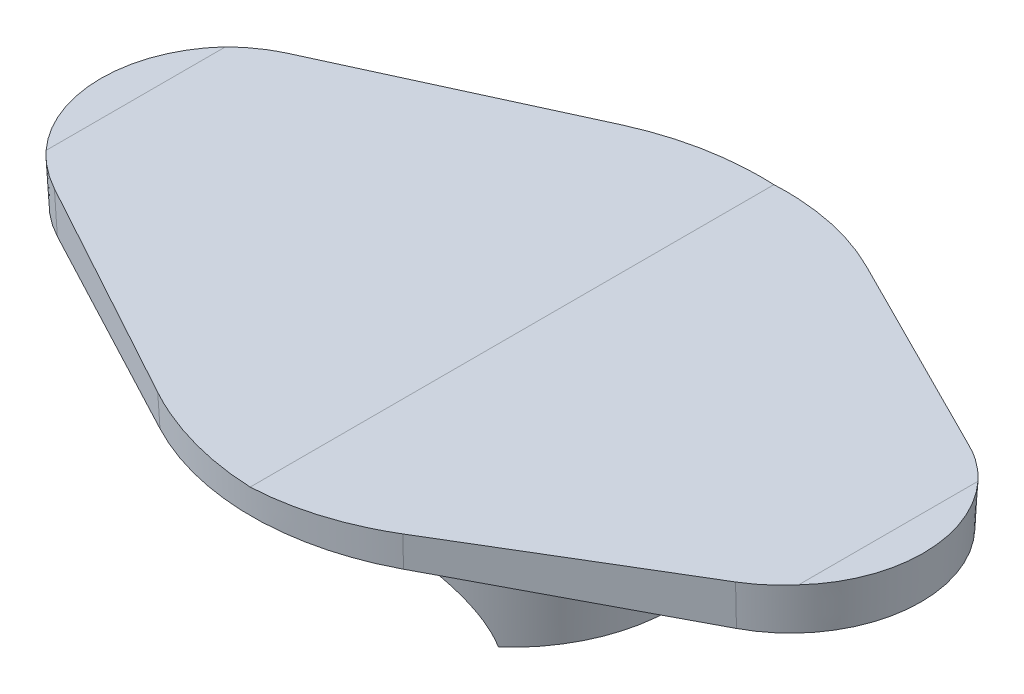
ISO-10303-21;
HEADER;
FILE_DESCRIPTION(('STEP AP214'),'2;1');
FILE_NAME('part.step','',(''),(''),'','','');
FILE_SCHEMA(('AUTOMOTIVE_DESIGN { 1 0 10303 214 1 1 1 1 }'));
ENDSEC;
DATA;
#1=APPLICATION_CONTEXT('core data for automotive mechanical design processes');
#2=APPLICATION_PROTOCOL_DEFINITION('international standard','automotive_design',2000,#1);
#3=PRODUCT_CONTEXT('',#1,'mechanical');
#4=PRODUCT('Part','Part','',(#3));
#5=PRODUCT_RELATED_PRODUCT_CATEGORY('part','',(#4));
#6=PRODUCT_DEFINITION_FORMATION('','',#4);
#7=PRODUCT_DEFINITION_CONTEXT('part definition',#1,'design');
#8=PRODUCT_DEFINITION('design','',#6,#7);
#9=PRODUCT_DEFINITION_SHAPE('','',#8);
#10=(LENGTH_UNIT() NAMED_UNIT(*) SI_UNIT(.MILLI.,.METRE.));
#11=(NAMED_UNIT(*) PLANE_ANGLE_UNIT() SI_UNIT($,.RADIAN.));
#12=(NAMED_UNIT(*) SI_UNIT($,.STERADIAN.) SOLID_ANGLE_UNIT());
#13=UNCERTAINTY_MEASURE_WITH_UNIT(LENGTH_MEASURE(1.E-05),#10,'distance_accuracy_value','');
#14=(GEOMETRIC_REPRESENTATION_CONTEXT(3) GLOBAL_UNCERTAINTY_ASSIGNED_CONTEXT((#13)) GLOBAL_UNIT_ASSIGNED_CONTEXT((#10,
#11,#12)) REPRESENTATION_CONTEXT('',''));
#15=CARTESIAN_POINT('',(0.,0.,0.));
#16=DIRECTION('',(0.,0.,1.));
#17=DIRECTION('',(1.,0.,0.));
#18=AXIS2_PLACEMENT_3D('',#15,#16,#17);
#19=CARTESIAN_POINT('',(0.,0.,0.));
#20=DIRECTION('',(0.,1.,0.));
#21=DIRECTION('',(0.,0.,1.));
#22=AXIS2_PLACEMENT_3D('',#19,#20,#21);
#23=CONICAL_SURFACE('',#22,7.62,0.05235987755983);
#24=CARTESIAN_POINT('',(0.0185301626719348,0.762855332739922,0.));
#25=DIRECTION('',(-0.0461098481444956,0.998936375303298,0.));
#26=DIRECTION('',(0.998936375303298,0.0461098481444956,0.));
#27=AXIS2_PLACEMENT_3D('',#24,#25,#26);
#28=ELLIPSE('',#27,7.66813557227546,7.65995714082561);
#29=CARTESIAN_POINT('',(3.58431728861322,0.927448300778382,-6.7793937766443));
#30=VERTEX_POINT('',#29);
#31=CARTESIAN_POINT('',(0.,0.762,-7.65993472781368));
#32=VERTEX_POINT('',#31);
#33=EDGE_CURVE('E159',#30,#32,#28,.T.);
#34=ORIENTED_EDGE('',*,*,#33,.F.);
#35=DIRECTION('',(0.024461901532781,0.998629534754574,-0.0462673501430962));
#36=VECTOR('',#35,1.);
#37=CARTESIAN_POINT('',(3.56159900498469,0.,-6.73642431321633));
#38=LINE('',#37,#36);
#39=CARTESIAN_POINT('',(3.56159900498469,0.,-6.73642431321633));
#40=VERTEX_POINT('',#39);
#41=EDGE_CURVE('E327',#30,#40,#38,.F.);
#42=ORIENTED_EDGE('',*,*,#41,.T.);
#43=CARTESIAN_POINT('',(0.,0.,0.));
#44=DIRECTION('',(0.,1.,0.));
#45=DIRECTION('',(0.,0.,1.));
#46=AXIS2_PLACEMENT_3D('',#43,#44,#45);
#47=CIRCLE('',#46,7.62);
#48=CARTESIAN_POINT('',(-3.56159900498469,0.,-6.73642431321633));
#49=VERTEX_POINT('',#48);
#50=EDGE_CURVE('E308',#40,#49,#47,.T.);
#51=ORIENTED_EDGE('',*,*,#50,.T.);
#52=DIRECTION('',(-0.024461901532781,0.998629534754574,-0.0462673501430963));
#53=VECTOR('',#52,1.);
#54=CARTESIAN_POINT('',(-3.56159900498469,0.,-6.73642431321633));
#55=LINE('',#54,#53);
#56=CARTESIAN_POINT('',(-3.58431728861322,0.927448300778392,-6.77939377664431));
#57=VERTEX_POINT('',#56);
#58=EDGE_CURVE('E278',#57,#49,#55,.F.);
#59=ORIENTED_EDGE('',*,*,#58,.F.);
#60=CARTESIAN_POINT('',(-0.0185301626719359,0.762855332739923,0.));
#61=DIRECTION('',(-0.0461098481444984,-0.998936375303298,0.));
#62=DIRECTION('',(-0.998936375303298,0.0461098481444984,0.));
#63=AXIS2_PLACEMENT_3D('',#60,#61,#62);
#64=ELLIPSE('',#63,7.66813557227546,7.65995714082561);
#65=EDGE_CURVE('E181',#57,#32,#64,.T.);
#66=ORIENTED_EDGE('',*,*,#65,.T.);
#67=EDGE_LOOP('',(#34,#42,#51,#59,#66));
#68=FACE_BOUND('',#67,.T.);
#69=ADVANCED_FACE('F35',(#68),#23,.T.);
#70=CARTESIAN_POINT('',(0.,0.,0.));
#71=DIRECTION('',(0.,1.,0.));
#72=DIRECTION('',(0.,0.,1.));
#73=AXIS2_PLACEMENT_3D('',#70,#71,#72);
#74=CONICAL_SURFACE('',#73,7.61999999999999,0.05235987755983);
#75=CARTESIAN_POINT('',(0.0185301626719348,0.762855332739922,0.));
#76=DIRECTION('',(-0.0461098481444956,0.998936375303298,0.));
#77=DIRECTION('',(0.998936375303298,0.0461098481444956,0.));
#78=AXIS2_PLACEMENT_3D('',#75,#76,#77);
#79=ELLIPSE('',#78,7.66813557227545,7.65995714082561);
#80=CARTESIAN_POINT('',(0.,0.762,7.65993472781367));
#81=VERTEX_POINT('',#80);
#82=CARTESIAN_POINT('',(3.58431728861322,0.927448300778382,6.7793937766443));
#83=VERTEX_POINT('',#82);
#84=EDGE_CURVE('E166',#81,#83,#79,.T.);
#85=ORIENTED_EDGE('',*,*,#84,.F.);
#86=CARTESIAN_POINT('',(-0.0185301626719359,0.762855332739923,0.));
#87=DIRECTION('',(-0.0461098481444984,-0.998936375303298,0.));
#88=DIRECTION('',(-0.998936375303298,0.0461098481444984,0.));
#89=AXIS2_PLACEMENT_3D('',#86,#87,#88);
#90=ELLIPSE('',#89,7.66813557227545,7.65995714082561);
#91=CARTESIAN_POINT('',(-3.58431728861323,0.927448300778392,6.7793937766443));
#92=VERTEX_POINT('',#91);
#93=EDGE_CURVE('E148',#81,#92,#90,.T.);
#94=ORIENTED_EDGE('',*,*,#93,.T.);
#95=DIRECTION('',(-0.0244619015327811,0.998629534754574,0.0462673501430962));
#96=VECTOR('',#95,1.);
#97=CARTESIAN_POINT('',(-3.56159900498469,0.,6.73642431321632));
#98=LINE('',#97,#96);
#99=CARTESIAN_POINT('',(-3.56159900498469,0.,6.73642431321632));
#100=VERTEX_POINT('',#99);
#101=EDGE_CURVE('E283',#92,#100,#98,.F.);
#102=ORIENTED_EDGE('',*,*,#101,.T.);
#103=CARTESIAN_POINT('',(0.,0.,0.));
#104=DIRECTION('',(0.,1.,0.));
#105=DIRECTION('',(0.,0.,1.));
#106=AXIS2_PLACEMENT_3D('',#103,#104,#105);
#107=CIRCLE('',#106,7.61999999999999);
#108=CARTESIAN_POINT('',(3.56159900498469,0.,6.73642431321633));
#109=VERTEX_POINT('',#108);
#110=EDGE_CURVE('E317',#100,#109,#107,.T.);
#111=ORIENTED_EDGE('',*,*,#110,.T.);
#112=DIRECTION('',(0.024461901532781,0.998629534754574,0.0462673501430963));
#113=VECTOR('',#112,1.);
#114=CARTESIAN_POINT('',(3.56159900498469,0.,6.73642431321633));
#115=LINE('',#114,#113);
#116=EDGE_CURVE('E333',#83,#109,#115,.F.);
#117=ORIENTED_EDGE('',*,*,#116,.F.);
#118=EDGE_LOOP('',(#85,#94,#102,#111,#117));
#119=FACE_BOUND('',#118,.T.);
#120=ADVANCED_FACE('F243',(#119),#74,.T.);
#121=CARTESIAN_POINT('',(9.93225056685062,0.,3.36821215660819));
#122=DIRECTION('',(0.466760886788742,-0.0523359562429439,0.882833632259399));
#123=DIRECTION('',(0.88404518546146,0.,-0.467401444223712));
#124=AXIS2_PLACEMENT_3D('',#121,#122,#123);
#125=PLANE('',#124);
#126=DIRECTION('',(-0.88430624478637,-0.0408186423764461,0.465119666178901));
#127=VECTOR('',#126,1.);
#128=CARTESIAN_POINT('',(9.91795517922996,1.21980233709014,3.44808230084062));
#129=LINE('',#128,#127);
#130=CARTESIAN_POINT('',(9.9621802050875,1.22184371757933,3.4248212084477));
#131=VERTEX_POINT('',#130);
#132=EDGE_CURVE('E165',#83,#131,#129,.F.);
#133=ORIENTED_EDGE('',*,*,#132,.F.);
#134=ORIENTED_EDGE('',*,*,#116,.T.);
#135=DIRECTION('',(0.88404518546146,0.,-0.467401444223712));
#136=VECTOR('',#135,1.);
#137=CARTESIAN_POINT('',(9.93225056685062,0.,3.36821215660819));
#138=LINE('',#137,#136);
#139=CARTESIAN_POINT('',(9.93225056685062,0.,3.36821215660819));
#140=VERTEX_POINT('',#139);
#141=EDGE_CURVE('E320',#109,#140,#138,.T.);
#142=ORIENTED_EDGE('',*,*,#141,.T.);
#143=DIRECTION('',(0.0244619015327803,0.998629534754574,0.0462673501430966));
#144=VECTOR('',#143,1.);
#145=CARTESIAN_POINT('',(9.93225056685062,0.,3.36821215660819));
#146=LINE('',#145,#144);
#147=EDGE_CURVE('E331',#131,#140,#146,.F.);
#148=ORIENTED_EDGE('',*,*,#147,.F.);
#149=EDGE_LOOP('',(#133,#134,#142,#148));
#150=FACE_BOUND('',#149,.T.);
#151=ADVANCED_FACE('F251',(#150),#125,.T.);
#152=CARTESIAN_POINT('',(8.15145106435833,0.,0.));
#153=DIRECTION('',(0.,1.,0.));
#154=DIRECTION('',(0.,0.,1.));
#155=AXIS2_PLACEMENT_3D('',#152,#153,#154);
#156=CONICAL_SURFACE('',#155,3.81,0.05235987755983);
#157=CARTESIAN_POINT('',(8.16081215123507,1.13869447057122,0.));
#158=DIRECTION('',(-0.0461098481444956,0.998936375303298,0.));
#159=DIRECTION('',(0.998936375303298,0.0461098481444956,0.));
#160=AXIS2_PLACEMENT_3D('',#157,#158,#159);
#161=ELLIPSE('',#160,3.87379671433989,3.86966512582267);
#162=CARTESIAN_POINT('',(11.0054510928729,1.27,-2.62342997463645));
#163=VERTEX_POINT('',#162);
#164=CARTESIAN_POINT('',(9.9621802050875,1.22184371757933,-3.4248212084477));
#165=VERTEX_POINT('',#164);
#166=EDGE_CURVE('E50',#163,#165,#161,.T.);
#167=ORIENTED_EDGE('',*,*,#166,.F.);
#168=CARTESIAN_POINT('',(8.15145106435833,1.27,0.));
#169=DIRECTION('',(0.,-1.,0.));
#170=DIRECTION('',(0.,0.,-1.));
#171=AXIS2_PLACEMENT_3D('',#168,#169,#170);
#172=CIRCLE('',#171,3.87655787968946);
#173=CARTESIAN_POINT('',(11.0054510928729,1.27,2.62342997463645));
#174=VERTEX_POINT('',#173);
#175=EDGE_CURVE('E143',#163,#174,#172,.T.);
#176=ORIENTED_EDGE('',*,*,#175,.T.);
#177=EDGE_CURVE('E152',#131,#174,#161,.T.);
#178=ORIENTED_EDGE('',*,*,#177,.F.);
#179=ORIENTED_EDGE('',*,*,#147,.T.);
#180=CARTESIAN_POINT('',(8.15145106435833,0.,0.));
#181=DIRECTION('',(0.,1.,0.));
#182=DIRECTION('',(0.,0.,1.));
#183=AXIS2_PLACEMENT_3D('',#180,#181,#182);
#184=CIRCLE('',#183,3.81);
#185=CARTESIAN_POINT('',(9.93225056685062,0.,-3.36821215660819));
#186=VERTEX_POINT('',#185);
#187=EDGE_CURVE('E323',#140,#186,#184,.T.);
#188=ORIENTED_EDGE('',*,*,#187,.T.);
#189=DIRECTION('',(0.024461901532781,0.998629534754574,-0.0462673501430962));
#190=VECTOR('',#189,1.);
#191=CARTESIAN_POINT('',(9.93225056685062,0.,-3.36821215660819));
#192=LINE('',#191,#190);
#193=EDGE_CURVE('E158',#165,#186,#192,.F.);
#194=ORIENTED_EDGE('',*,*,#193,.F.);
#195=EDGE_LOOP('',(#167,#176,#178,#179,#188,#194));
#196=FACE_BOUND('',#195,.T.);
#197=ADVANCED_FACE('F156',(#196),#156,.T.);
#198=CARTESIAN_POINT('',(3.56159900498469,0.,-6.73642431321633));
#199=DIRECTION('',(0.466760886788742,-0.0523359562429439,-0.882833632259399));
#200=DIRECTION('',(-0.88404518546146,0.,-0.467401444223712));
#201=AXIS2_PLACEMENT_3D('',#198,#199,#200);
#202=PLANE('',#201);
#203=DIRECTION('',(0.88430624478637,0.0408186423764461,0.465119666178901));
#204=VECTOR('',#203,1.);
#205=CARTESIAN_POINT('',(3.5507479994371,0.925898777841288,-6.79705025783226));
#206=LINE('',#205,#204);
#207=EDGE_CURVE('E149',#165,#30,#206,.F.);
#208=ORIENTED_EDGE('',*,*,#207,.F.);
#209=ORIENTED_EDGE('',*,*,#193,.T.);
#210=DIRECTION('',(-0.88404518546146,0.,-0.467401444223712));
#211=VECTOR('',#210,1.);
#212=CARTESIAN_POINT('',(3.56159900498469,0.,-6.73642431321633));
#213=LINE('',#212,#211);
#214=EDGE_CURVE('E325',#186,#40,#213,.T.);
#215=ORIENTED_EDGE('',*,*,#214,.T.);
#216=ORIENTED_EDGE('',*,*,#41,.F.);
#217=EDGE_LOOP('',(#208,#209,#215,#216));
#218=FACE_BOUND('',#217,.T.);
#219=ADVANCED_FACE('F245',(#218),#202,.T.);
#220=CARTESIAN_POINT('',(0.,-3.81,0.));
#221=DIRECTION('',(0.,-1.,0.));
#222=DIRECTION('',(0.,0.,-1.));
#223=AXIS2_PLACEMENT_3D('',#220,#221,#222);
#224=PLANE('',#223);
#225=DIRECTION('',(0.,0.,1.));
#226=VECTOR('',#225,1.);
#227=CARTESIAN_POINT('',(3.11085197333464,-3.81,-7.69986945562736));
#228=LINE('',#227,#226);
#229=CARTESIAN_POINT('',(3.11085197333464,-3.81,-3.50956853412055));
#230=VERTEX_POINT('',#229);
#231=CARTESIAN_POINT('',(3.11085197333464,-3.81,-3.00782840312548));
#232=VERTEX_POINT('',#231);
#233=EDGE_CURVE('E186',#230,#232,#228,.T.);
#234=ORIENTED_EDGE('',*,*,#233,.F.);
#235=CARTESIAN_POINT('',(0.,-3.81,0.));
#236=DIRECTION('',(0.,-1.,0.));
#237=DIRECTION('',(0.,0.,-1.));
#238=AXIS2_PLACEMENT_3D('',#235,#236,#237);
#239=CIRCLE('',#238,4.68982636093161);
#240=CARTESIAN_POINT('',(3.11085197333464,-3.81,3.50956853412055));
#241=VERTEX_POINT('',#240);
#242=EDGE_CURVE('E307',#230,#241,#239,.T.);
#243=ORIENTED_EDGE('',*,*,#242,.T.);
#244=CARTESIAN_POINT('',(3.11085197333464,-3.81,3.00782840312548));
#245=VERTEX_POINT('',#244);
#246=EDGE_CURVE('E189',#245,#241,#228,.T.);
#247=ORIENTED_EDGE('',*,*,#246,.F.);
#248=CARTESIAN_POINT('',(0.,-3.81,0.));
#249=DIRECTION('',(0.,-1.,0.));
#250=DIRECTION('',(0.,0.,-1.));
#251=AXIS2_PLACEMENT_3D('',#248,#249,#250);
#252=CIRCLE('',#251,4.32717363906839);
#253=EDGE_CURVE('E303',#232,#245,#252,.T.);
#254=ORIENTED_EDGE('',*,*,#253,.F.);
#255=EDGE_LOOP('',(#234,#243,#247,#254));
#256=FACE_BOUND('',#255,.T.);
#257=ADVANCED_FACE('F239',(#256),#224,.T.);
#258=CARTESIAN_POINT('',(0.,0.,0.));
#259=DIRECTION('',(0.,1.,0.));
#260=DIRECTION('',(0.,0.,1.));
#261=AXIS2_PLACEMENT_3D('',#258,#259,#260);
#262=PLANE('',#261);
#263=ORIENTED_EDGE('',*,*,#50,.F.);
#264=ORIENTED_EDGE('',*,*,#214,.F.);
#265=ORIENTED_EDGE('',*,*,#187,.F.);
#266=ORIENTED_EDGE('',*,*,#141,.F.);
#267=ORIENTED_EDGE('',*,*,#110,.F.);
#268=DIRECTION('',(0.88404518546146,0.,0.467401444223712));
#269=VECTOR('',#268,1.);
#270=CARTESIAN_POINT('',(-9.93225056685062,0.,3.36821215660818));
#271=LINE('',#270,#269);
#272=CARTESIAN_POINT('',(-9.93225056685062,0.,3.36821215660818));
#273=VERTEX_POINT('',#272);
#274=EDGE_CURVE('E314',#273,#100,#271,.T.);
#275=ORIENTED_EDGE('',*,*,#274,.F.);
#276=CARTESIAN_POINT('',(-8.15145106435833,0.,0.));
#277=DIRECTION('',(0.,1.,0.));
#278=DIRECTION('',(0.,0.,-1.));
#279=AXIS2_PLACEMENT_3D('',#276,#277,#278);
#280=CIRCLE('',#279,3.81);
#281=CARTESIAN_POINT('',(-9.93225056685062,0.,-3.36821215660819));
#282=VERTEX_POINT('',#281);
#283=EDGE_CURVE('E312',#282,#273,#280,.T.);
#284=ORIENTED_EDGE('',*,*,#283,.F.);
#285=DIRECTION('',(-0.88404518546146,0.,0.467401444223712));
#286=VECTOR('',#285,1.);
#287=CARTESIAN_POINT('',(-3.56159900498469,0.,-6.73642431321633));
#288=LINE('',#287,#286);
#289=EDGE_CURVE('E274',#49,#282,#288,.T.);
#290=ORIENTED_EDGE('',*,*,#289,.F.);
#291=EDGE_LOOP('',(#263,#264,#265,#266,#267,#275,#284,#290));
#292=FACE_BOUND('',#291,.T.);
#293=CARTESIAN_POINT('',(0.,0.,0.));
#294=DIRECTION('',(0.,1.,0.));
#295=DIRECTION('',(0.,0.,1.));
#296=AXIS2_PLACEMENT_3D('',#293,#294,#295);
#297=CIRCLE('',#296,4.8895);
#298=CARTESIAN_POINT('',(0.,0.,4.8895));
#299=VERTEX_POINT('',#298);
#300=EDGE_CURVE('E281',#299,#299,#297,.F.);
#301=ORIENTED_EDGE('',*,*,#300,.F.);
#302=EDGE_LOOP('',(#301));
#303=FACE_BOUND('',#302,.T.);
#304=ADVANCED_FACE('F234',(#292,#303),#262,.F.);
#305=CARTESIAN_POINT('',(-3.56159900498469,0.,-6.73642431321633));
#306=DIRECTION('',(-0.466760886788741,-0.0523359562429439,-0.882833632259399));
#307=DIRECTION('',(-0.88404518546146,0.,0.467401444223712));
#308=AXIS2_PLACEMENT_3D('',#305,#306,#307);
#309=PLANE('',#308);
#310=DIRECTION('',(-0.0244619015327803,0.998629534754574,-0.0462673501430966));
#311=VECTOR('',#310,1.);
#312=CARTESIAN_POINT('',(-9.93225056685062,0.,-3.36821215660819));
#313=LINE('',#312,#311);
#314=CARTESIAN_POINT('',(-9.96218020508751,1.22184371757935,-3.4248212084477));
#315=VERTEX_POINT('',#314);
#316=EDGE_CURVE('E271',#315,#282,#313,.F.);
#317=ORIENTED_EDGE('',*,*,#316,.F.);
#318=DIRECTION('',(-0.88430624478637,0.0408186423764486,0.4651196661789));
#319=VECTOR('',#318,1.);
#320=CARTESIAN_POINT('',(-3.55074799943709,0.925898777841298,-6.79705025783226));
#321=LINE('',#320,#319);
#322=EDGE_CURVE('E178',#315,#57,#321,.F.);
#323=ORIENTED_EDGE('',*,*,#322,.T.);
#324=ORIENTED_EDGE('',*,*,#58,.T.);
#325=ORIENTED_EDGE('',*,*,#289,.T.);
#326=EDGE_LOOP('',(#317,#323,#324,#325));
#327=FACE_BOUND('',#326,.T.);
#328=ADVANCED_FACE('F238',(#327),#309,.T.);
#329=CARTESIAN_POINT('',(-8.15145106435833,0.,0.));
#330=DIRECTION('',(0.,1.,0.));
#331=DIRECTION('',(0.,0.,-1.));
#332=AXIS2_PLACEMENT_3D('',#329,#330,#331);
#333=CONICAL_SURFACE('',#332,3.81,0.05235987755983);
#334=CARTESIAN_POINT('',(-8.15145106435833,1.27,0.));
#335=DIRECTION('',(0.,-1.,0.));
#336=DIRECTION('',(0.,0.,-1.));
#337=AXIS2_PLACEMENT_3D('',#334,#335,#336);
#338=CIRCLE('',#337,3.87655787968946);
#339=CARTESIAN_POINT('',(-11.0054510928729,1.27,2.62342997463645));
#340=VERTEX_POINT('',#339);
#341=CARTESIAN_POINT('',(-11.0054510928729,1.27,-2.62342997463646));
#342=VERTEX_POINT('',#341);
#343=EDGE_CURVE('E353',#340,#342,#338,.T.);
#344=ORIENTED_EDGE('',*,*,#343,.T.);
#345=CARTESIAN_POINT('',(-8.16081215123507,1.13869447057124,0.));
#346=DIRECTION('',(-0.0461098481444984,-0.998936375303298,0.));
#347=DIRECTION('',(-0.998936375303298,0.0461098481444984,0.));
#348=AXIS2_PLACEMENT_3D('',#345,#346,#347);
#349=ELLIPSE('',#348,3.87379671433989,3.86966512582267);
#350=EDGE_CURVE('E177',#342,#315,#349,.T.);
#351=ORIENTED_EDGE('',*,*,#350,.T.);
#352=ORIENTED_EDGE('',*,*,#316,.T.);
#353=ORIENTED_EDGE('',*,*,#283,.T.);
#354=DIRECTION('',(-0.024461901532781,0.998629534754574,0.0462673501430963));
#355=VECTOR('',#354,1.);
#356=CARTESIAN_POINT('',(-9.93225056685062,0.,3.36821215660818));
#357=LINE('',#356,#355);
#358=CARTESIAN_POINT('',(-9.9621802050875,1.22184371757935,3.42482120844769));
#359=VERTEX_POINT('',#358);
#360=EDGE_CURVE('E279',#359,#273,#357,.F.);
#361=ORIENTED_EDGE('',*,*,#360,.F.);
#362=EDGE_CURVE('E174',#359,#340,#349,.T.);
#363=ORIENTED_EDGE('',*,*,#362,.T.);
#364=EDGE_LOOP('',(#344,#351,#352,#353,#361,#363));
#365=FACE_BOUND('',#364,.T.);
#366=ADVANCED_FACE('F261',(#365),#333,.T.);
#367=CARTESIAN_POINT('',(-9.93225056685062,0.,3.36821215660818));
#368=DIRECTION('',(-0.466760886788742,-0.0523359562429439,0.882833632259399));
#369=DIRECTION('',(0.88404518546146,0.,0.467401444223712));
#370=AXIS2_PLACEMENT_3D('',#367,#368,#369);
#371=PLANE('',#370);
#372=ORIENTED_EDGE('',*,*,#101,.F.);
#373=DIRECTION('',(0.88430624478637,-0.0408186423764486,0.465119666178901));
#374=VECTOR('',#373,1.);
#375=CARTESIAN_POINT('',(-9.91795517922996,1.21980233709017,3.44808230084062));
#376=LINE('',#375,#374);
#377=EDGE_CURVE('E169',#92,#359,#376,.F.);
#378=ORIENTED_EDGE('',*,*,#377,.T.);
#379=ORIENTED_EDGE('',*,*,#360,.T.);
#380=ORIENTED_EDGE('',*,*,#274,.T.);
#381=EDGE_LOOP('',(#372,#378,#379,#380));
#382=FACE_BOUND('',#381,.T.);
#383=ADVANCED_FACE('F258',(#382),#371,.T.);
#384=DIRECTION('',(0.,0.,1.));
#385=VECTOR('',#384,1.);
#386=CARTESIAN_POINT('',(-3.11085197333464,-3.81,-7.69986945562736));
#387=LINE('',#386,#385);
#388=CARTESIAN_POINT('',(-3.11085197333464,-3.81,3.50956853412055));
#389=VERTEX_POINT('',#388);
#390=CARTESIAN_POINT('',(-3.11085197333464,-3.81,3.00782840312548));
#391=VERTEX_POINT('',#390);
#392=EDGE_CURVE('E58',#389,#391,#387,.F.);
#393=ORIENTED_EDGE('',*,*,#392,.F.);
#394=CARTESIAN_POINT('',(-3.11085197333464,-3.81,-3.50956853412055));
#395=VERTEX_POINT('',#394);
#396=EDGE_CURVE('E302',#389,#395,#239,.T.);
#397=ORIENTED_EDGE('',*,*,#396,.T.);
#398=CARTESIAN_POINT('',(-3.11085197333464,-3.81,-3.00782840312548));
#399=VERTEX_POINT('',#398);
#400=EDGE_CURVE('E184',#399,#395,#387,.F.);
#401=ORIENTED_EDGE('',*,*,#400,.F.);
#402=EDGE_CURVE('E300',#391,#399,#252,.T.);
#403=ORIENTED_EDGE('',*,*,#402,.F.);
#404=EDGE_LOOP('',(#393,#397,#401,#403));
#405=FACE_BOUND('',#404,.T.);
#406=ADVANCED_FACE('F213',(#405),#224,.T.);
#407=CARTESIAN_POINT('',(0.,0.,0.));
#408=DIRECTION('',(0.,1.,0.));
#409=DIRECTION('',(0.,0.,-1.));
#410=AXIS2_PLACEMENT_3D('',#407,#408,#409);
#411=CONICAL_SURFACE('',#410,4.8895,0.05235987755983);
#412=ORIENTED_EDGE('',*,*,#396,.F.);
#413=CARTESIAN_POINT('',(-3.11089279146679,-3.81020000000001,3.5095183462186));
#414=CARTESIAN_POINT('',(-3.09244623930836,-3.71981178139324,3.53219478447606));
#415=CARTESIAN_POINT('',(-3.07022673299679,-3.63101749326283,3.55776072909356));
#416=CARTESIAN_POINT('',(-3.01876055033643,-3.45711295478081,3.61341733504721));
#417=CARTESIAN_POINT('',(-2.98952552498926,-3.37199686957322,3.64350046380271));
#418=CARTESIAN_POINT('',(-2.92463203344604,-3.20602550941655,3.70687441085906));
#419=CARTESIAN_POINT('',(-2.88900361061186,-3.12515249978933,3.74014990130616));
#420=CARTESIAN_POINT('',(-2.811591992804,-2.96740049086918,3.80896841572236));
#421=CARTESIAN_POINT('',(-2.76980596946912,-2.89052334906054,3.84451247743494));
#422=CARTESIAN_POINT('',(-2.63621087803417,-2.66707826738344,3.95262261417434));
#423=CARTESIAN_POINT('',(-2.53570045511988,-2.52652767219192,4.02713949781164));
#424=CARTESIAN_POINT('',(-2.31274635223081,-2.26285481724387,4.17501454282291));
#425=CARTESIAN_POINT('',(-2.19024911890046,-2.13977645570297,4.2483693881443));
#426=CARTESIAN_POINT('',(-1.9084978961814,-1.90015469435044,4.39647481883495));
#427=CARTESIAN_POINT('',(-1.74661307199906,-1.78609249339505,4.47037034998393));
#428=CARTESIAN_POINT('',(-1.48659605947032,-1.63775628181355,4.56879427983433));
#429=CARTESIAN_POINT('',(-1.3971162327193,-1.59212381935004,4.59951798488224));
#430=CARTESIAN_POINT('',(-1.21293982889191,-1.50908465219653,4.65597506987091));
#431=CARTESIAN_POINT('',(-1.11824568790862,-1.47167414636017,4.68171075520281));
#432=CARTESIAN_POINT('',(-0.882410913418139,-1.39156822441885,4.73719326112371));
#433=CARTESIAN_POINT('',(-0.738886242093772,-1.35357803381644,4.76386554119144));
#434=CARTESIAN_POINT('',(-0.44613625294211,-1.29797490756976,4.80305947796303));
#435=CARTESIAN_POINT('',(-0.296914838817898,-1.28034826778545,4.81559065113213));
#436=CARTESIAN_POINT('',(0.00332292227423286,-1.26644246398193,4.82546847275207));
#437=CARTESIAN_POINT('',(0.154342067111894,-1.27020264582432,4.82278713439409));
#438=CARTESIAN_POINT('',(0.453316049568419,-1.29893889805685,4.80240759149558));
#439=CARTESIAN_POINT('',(0.601270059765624,-1.32392062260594,4.7847053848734));
#440=CARTESIAN_POINT('',(0.886852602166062,-1.39291158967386,4.73631790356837));
#441=CARTESIAN_POINT('',(1.02463617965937,-1.4364927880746,4.70592501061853));
#442=CARTESIAN_POINT('',(1.29058115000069,-1.54061716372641,4.6343876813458));
#443=CARTESIAN_POINT('',(1.41874144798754,-1.60116226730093,4.59324202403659));
#444=CARTESIAN_POINT('',(1.67742492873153,-1.74478664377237,4.49763192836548));
#445=CARTESIAN_POINT('',(1.80660096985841,-1.82963167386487,4.44219127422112));
#446=CARTESIAN_POINT('',(2.04962821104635,-2.01537113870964,4.32466953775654));
#447=CARTESIAN_POINT('',(2.16345723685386,-2.11628834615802,4.26257907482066));
#448=CARTESIAN_POINT('',(2.39417056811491,-2.3520267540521,4.1238516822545));
#449=CARTESIAN_POINT('',(2.50782023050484,-2.48967418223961,4.04662823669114));
#450=CARTESIAN_POINT('',(2.71092910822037,-2.782708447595,3.89476328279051));
#451=CARTESIAN_POINT('',(2.8004332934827,-2.93806152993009,3.82011720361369));
#452=CARTESIAN_POINT('',(2.92856267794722,-3.21249714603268,3.70372220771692));
#453=CARTESIAN_POINT('',(2.97428150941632,-3.32706517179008,3.65914053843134));
#454=CARTESIAN_POINT('',(3.05269338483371,-3.56341649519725,3.57771889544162));
#455=CARTESIAN_POINT('',(3.08536159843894,-3.68521304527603,3.54089374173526));
#456=CARTESIAN_POINT('',(3.11089279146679,-3.81020000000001,3.5095183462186));
#457=B_SPLINE_CURVE_WITH_KNOTS('',3,(#413,#414,#415,#416,#417,#418,#419,#420,#421,#422,#423,
#424,#425,#426,#427,#428,#429,#430,#431,#432,#433,#434,#435,#436,#437,#438,#439,#440,#441,#442,
#443,#444,#445,#446,#447,#448,#449,#450,#451,#452,#453,#454,#455,#456),.UNSPECIFIED.,.F.,.F.,(4,
2,2,2,2,2,2,2,2,2,2,2,2,2,2,2,2,2,2,2,2,4),(0.,0.284724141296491,0.56897866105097,
0.851930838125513,1.13501339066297,1.6971905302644,2.2607560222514,2.8907640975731,
3.20539951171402,3.51988915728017,3.9703151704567,4.42043788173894,4.87138896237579,
5.32246022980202,5.76366738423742,6.20492465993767,6.69567207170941,7.18712111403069,
7.76827254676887,8.34833401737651,8.74083610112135,9.13408144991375),.UNSPECIFIED.);
#458=EDGE_CURVE('E197',#389,#241,#457,.T.);
#459=ORIENTED_EDGE('',*,*,#458,.T.);
#460=ORIENTED_EDGE('',*,*,#242,.F.);
#461=CARTESIAN_POINT('',(3.11089279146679,-3.81020000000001,-3.5095183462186));
#462=CARTESIAN_POINT('',(3.09244623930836,-3.71981178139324,-3.53219478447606));
#463=CARTESIAN_POINT('',(3.07022673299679,-3.63101749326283,-3.55776072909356));
#464=CARTESIAN_POINT('',(3.01876055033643,-3.45711295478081,-3.61341733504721));
#465=CARTESIAN_POINT('',(2.98952552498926,-3.37199686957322,-3.64350046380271));
#466=CARTESIAN_POINT('',(2.92463203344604,-3.20602550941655,-3.70687441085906));
#467=CARTESIAN_POINT('',(2.88900361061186,-3.12515249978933,-3.74014990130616));
#468=CARTESIAN_POINT('',(2.811591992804,-2.96740049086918,-3.80896841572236));
#469=CARTESIAN_POINT('',(2.76980596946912,-2.89052334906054,-3.84451247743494));
#470=CARTESIAN_POINT('',(2.63621087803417,-2.66707826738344,-3.95262261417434));
#471=CARTESIAN_POINT('',(2.53570045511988,-2.52652767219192,-4.02713949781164));
#472=CARTESIAN_POINT('',(2.31274635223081,-2.26285481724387,-4.17501454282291));
#473=CARTESIAN_POINT('',(2.19024911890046,-2.13977645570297,-4.2483693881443));
#474=CARTESIAN_POINT('',(1.9084978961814,-1.90015469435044,-4.39647481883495));
#475=CARTESIAN_POINT('',(1.74661307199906,-1.78609249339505,-4.47037034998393));
#476=CARTESIAN_POINT('',(1.48659605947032,-1.63775628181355,-4.56879427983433));
#477=CARTESIAN_POINT('',(1.3971162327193,-1.59212381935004,-4.59951798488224));
#478=CARTESIAN_POINT('',(1.21293982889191,-1.50908465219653,-4.65597506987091));
#479=CARTESIAN_POINT('',(1.11824568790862,-1.47167414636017,-4.68171075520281));
#480=CARTESIAN_POINT('',(0.882410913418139,-1.39156822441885,-4.73719326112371));
#481=CARTESIAN_POINT('',(0.738886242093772,-1.35357803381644,-4.76386554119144));
#482=CARTESIAN_POINT('',(0.44613625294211,-1.29797490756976,-4.80305947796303));
#483=CARTESIAN_POINT('',(0.296914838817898,-1.28034826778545,-4.81559065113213));
#484=CARTESIAN_POINT('',(-0.00332292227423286,-1.26644246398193,-4.82546847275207));
#485=CARTESIAN_POINT('',(-0.154342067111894,-1.27020264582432,-4.82278713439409));
#486=CARTESIAN_POINT('',(-0.453316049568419,-1.29893889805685,-4.80240759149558));
#487=CARTESIAN_POINT('',(-0.601270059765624,-1.32392062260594,-4.7847053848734));
#488=CARTESIAN_POINT('',(-0.886852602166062,-1.39291158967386,-4.73631790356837));
#489=CARTESIAN_POINT('',(-1.02463617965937,-1.4364927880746,-4.70592501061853));
#490=CARTESIAN_POINT('',(-1.29058115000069,-1.54061716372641,-4.6343876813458));
#491=CARTESIAN_POINT('',(-1.41874144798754,-1.60116226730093,-4.59324202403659));
#492=CARTESIAN_POINT('',(-1.67742492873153,-1.74478664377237,-4.49763192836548));
#493=CARTESIAN_POINT('',(-1.80660096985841,-1.82963167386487,-4.44219127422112));
#494=CARTESIAN_POINT('',(-2.04962821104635,-2.01537113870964,-4.32466953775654));
#495=CARTESIAN_POINT('',(-2.16345723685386,-2.11628834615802,-4.26257907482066));
#496=CARTESIAN_POINT('',(-2.39417056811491,-2.3520267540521,-4.1238516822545));
#497=CARTESIAN_POINT('',(-2.50782023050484,-2.48967418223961,-4.04662823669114));
#498=CARTESIAN_POINT('',(-2.71092910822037,-2.782708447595,-3.89476328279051));
#499=CARTESIAN_POINT('',(-2.8004332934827,-2.93806152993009,-3.82011720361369));
#500=CARTESIAN_POINT('',(-2.92856267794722,-3.21249714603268,-3.70372220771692));
#501=CARTESIAN_POINT('',(-2.97428150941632,-3.32706517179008,-3.65914053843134));
#502=CARTESIAN_POINT('',(-3.05269338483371,-3.56341649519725,-3.57771889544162));
#503=CARTESIAN_POINT('',(-3.08536159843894,-3.68521304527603,-3.54089374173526));
#504=CARTESIAN_POINT('',(-3.11089279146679,-3.81020000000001,-3.5095183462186));
#505=B_SPLINE_CURVE_WITH_KNOTS('',3,(#461,#462,#463,#464,#465,#466,#467,#468,#469,#470,#471,
#472,#473,#474,#475,#476,#477,#478,#479,#480,#481,#482,#483,#484,#485,#486,#487,#488,#489,#490,
#491,#492,#493,#494,#495,#496,#497,#498,#499,#500,#501,#502,#503,#504),.UNSPECIFIED.,.F.,.F.,(4,
2,2,2,2,2,2,2,2,2,2,2,2,2,2,2,2,2,2,2,2,4),(0.,0.284724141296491,0.56897866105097,
0.851930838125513,1.13501339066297,1.6971905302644,2.2607560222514,2.8907640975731,
3.20539951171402,3.51988915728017,3.9703151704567,4.42043788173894,4.87138896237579,
5.32246022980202,5.76366738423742,6.20492465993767,6.69567207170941,7.18712111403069,
7.76827254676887,8.34833401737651,8.74083610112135,9.13408144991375),.UNSPECIFIED.);
#506=EDGE_CURVE('E188',#230,#395,#505,.T.);
#507=ORIENTED_EDGE('',*,*,#506,.T.);
#508=EDGE_LOOP('',(#412,#459,#460,#507));
#509=FACE_BOUND('',#508,.T.);
#510=ORIENTED_EDGE('',*,*,#300,.T.);
#511=EDGE_LOOP('',(#510));
#512=FACE_BOUND('',#511,.T.);
#513=ADVANCED_FACE('F202',(#509,#512),#411,.T.);
#514=CARTESIAN_POINT('',(0.,0.,0.));
#515=DIRECTION('',(0.,-1.,0.));
#516=DIRECTION('',(0.,0.,-1.));
#517=AXIS2_PLACEMENT_3D('',#514,#515,#516);
#518=CONICAL_SURFACE('',#517,4.1275,0.05235987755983);
#519=CARTESIAN_POINT('',(0.,-0.100413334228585,0.));
#520=DIRECTION('',(0.,-1.,0.));
#521=DIRECTION('',(0.,0.,-1.));
#522=AXIS2_PLACEMENT_3D('',#519,#520,#521);
#523=CIRCLE('',#522,4.13276243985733);
#524=CARTESIAN_POINT('',(0.,-0.100413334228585,-4.13276243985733));
#525=VERTEX_POINT('',#524);
#526=EDGE_CURVE('E11',#525,#525,#523,.F.);
#527=ORIENTED_EDGE('',*,*,#526,.T.);
#528=EDGE_LOOP('',(#527));
#529=FACE_BOUND('',#528,.T.);
#530=CARTESIAN_POINT('',(-3.11089279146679,-3.81020000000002,3.00780126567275));
#531=CARTESIAN_POINT('',(-3.07645269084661,-3.64159117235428,3.03066157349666));
#532=CARTESIAN_POINT('',(-3.02901578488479,-3.47883568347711,3.06676704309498));
#533=CARTESIAN_POINT('',(-2.91168524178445,-3.16827037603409,3.156244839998));
#534=CARTESIAN_POINT('',(-2.84199468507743,-3.02034071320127,3.20946104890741));
#535=CARTESIAN_POINT('',(-2.68363693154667,-2.74077833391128,3.32417525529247));
#536=CARTESIAN_POINT('',(-2.59513275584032,-2.60902005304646,3.38560052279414));
#537=CARTESIAN_POINT('',(-2.39992973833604,-2.36028473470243,3.51091331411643));
#538=CARTESIAN_POINT('',(-2.2931680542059,-2.24336126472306,3.57480873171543));
#539=CARTESIAN_POINT('',(-2.03991250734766,-2.00467351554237,3.71183966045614));
#540=CARTESIAN_POINT('',(-1.88972913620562,-1.88638130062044,3.78435889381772));
#541=CARTESIAN_POINT('',(-1.6478322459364,-1.72939639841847,3.88393210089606));
#542=CARTESIAN_POINT('',(-1.56447130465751,-1.68049458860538,3.91557660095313));
#543=CARTESIAN_POINT('',(-1.39255100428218,-1.59002865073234,3.97493989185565));
#544=CARTESIAN_POINT('',(-1.30399355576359,-1.5484618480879,4.00266011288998));
#545=CARTESIAN_POINT('',(-1.07532471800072,-1.45393397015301,4.06634124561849));
#546=CARTESIAN_POINT('',(-0.932141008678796,-1.40612172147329,4.09919898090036));
#547=CARTESIAN_POINT('',(-0.638136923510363,-1.33109620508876,4.15114737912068));
#548=CARTESIAN_POINT('',(-0.487322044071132,-1.30386833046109,4.1702478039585));
#549=CARTESIAN_POINT('',(-0.181646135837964,-1.27146764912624,4.19300746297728));
#550=CARTESIAN_POINT('',(-0.0267736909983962,-1.26636578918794,4.19661702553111));
#551=CARTESIAN_POINT('',(0.281617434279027,-1.27875007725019,4.18789480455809));
#552=CARTESIAN_POINT('',(0.435135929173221,-1.29623927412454,4.17556086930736));
#553=CARTESIAN_POINT('',(0.728734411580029,-1.35132858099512,4.13711314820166));
#554=CARTESIAN_POINT('',(0.869104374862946,-1.38790245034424,4.11170337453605));
#555=CARTESIAN_POINT('',(1.14126637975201,-1.4787339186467,4.04956912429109));
#556=CARTESIAN_POINT('',(1.27305822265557,-1.53299192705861,4.01284438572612));
#557=CARTESIAN_POINT('',(1.53748644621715,-1.66284404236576,3.92688270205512));
#558=CARTESIAN_POINT('',(1.66911521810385,-1.73992699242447,3.87681300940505));
#559=CARTESIAN_POINT('',(1.91832797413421,-1.91053567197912,3.76978418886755));
#560=CARTESIAN_POINT('',(2.03588933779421,-2.00408730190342,3.71281425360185));
#561=CARTESIAN_POINT('',(2.27587396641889,-2.22416060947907,3.58525574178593));
#562=CARTESIAN_POINT('',(2.3953245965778,-2.35358499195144,3.51406880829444));
#563=CARTESIAN_POINT('',(2.61168335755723,-2.63098656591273,3.37476640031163));
#564=CARTESIAN_POINT('',(2.70864510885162,-2.77891830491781,3.30664393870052));
#565=CARTESIAN_POINT('',(2.86537780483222,-3.06911892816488,3.19177869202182));
#566=CARTESIAN_POINT('',(2.92856185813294,-3.20882916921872,3.14336007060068));
#567=CARTESIAN_POINT('',(3.03533447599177,-3.50070257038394,3.06196418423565));
#568=CARTESIAN_POINT('',(3.07879338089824,-3.65294057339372,3.0290890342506));
#569=CARTESIAN_POINT('',(3.11089279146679,-3.81020000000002,3.00780126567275));
#570=B_SPLINE_CURVE_WITH_KNOTS('',3,(#530,#531,#532,#533,#534,#535,#536,#537,#538,#539,#540,
#541,#542,#543,#544,#545,#546,#547,#548,#549,#550,#551,#552,#553,#554,#555,#556,#557,#558,#559,
#560,#561,#562,#563,#564,#565,#566,#567,#568,#569),.UNSPECIFIED.,.F.,.F.,(4,2,2,2,2,2,2,2,2,2,2,
2,2,2,2,2,2,2,2,4),(0.,0.517804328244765,1.03101224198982,1.5399423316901,2.05066077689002,
2.6605927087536,2.96528181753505,3.2698595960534,3.73122047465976,4.19225365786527,
4.65476404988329,5.11733686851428,5.5572687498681,5.99721081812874,6.47705609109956,
6.95766287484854,7.52527492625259,8.09151937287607,8.57167187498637,9.05493641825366),.UNSPECIFIED.);
#571=EDGE_CURVE('E224',#391,#245,#570,.T.);
#572=ORIENTED_EDGE('',*,*,#571,.F.);
#573=ORIENTED_EDGE('',*,*,#402,.T.);
#574=CARTESIAN_POINT('',(3.11089279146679,-3.81020000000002,-3.00780126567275));
#575=CARTESIAN_POINT('',(3.07645269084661,-3.64159117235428,-3.03066157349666));
#576=CARTESIAN_POINT('',(3.02901578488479,-3.47883568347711,-3.06676704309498));
#577=CARTESIAN_POINT('',(2.91168524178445,-3.16827037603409,-3.156244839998));
#578=CARTESIAN_POINT('',(2.84199468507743,-3.02034071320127,-3.20946104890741));
#579=CARTESIAN_POINT('',(2.68363693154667,-2.74077833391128,-3.32417525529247));
#580=CARTESIAN_POINT('',(2.59513275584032,-2.60902005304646,-3.38560052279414));
#581=CARTESIAN_POINT('',(2.39992973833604,-2.36028473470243,-3.51091331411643));
#582=CARTESIAN_POINT('',(2.2931680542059,-2.24336126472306,-3.57480873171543));
#583=CARTESIAN_POINT('',(2.03991250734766,-2.00467351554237,-3.71183966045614));
#584=CARTESIAN_POINT('',(1.88972913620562,-1.88638130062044,-3.78435889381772));
#585=CARTESIAN_POINT('',(1.6478322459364,-1.72939639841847,-3.88393210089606));
#586=CARTESIAN_POINT('',(1.56447130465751,-1.68049458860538,-3.91557660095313));
#587=CARTESIAN_POINT('',(1.39255100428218,-1.59002865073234,-3.97493989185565));
#588=CARTESIAN_POINT('',(1.30399355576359,-1.5484618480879,-4.00266011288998));
#589=CARTESIAN_POINT('',(1.07532471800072,-1.45393397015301,-4.06634124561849));
#590=CARTESIAN_POINT('',(0.932141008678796,-1.40612172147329,-4.09919898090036));
#591=CARTESIAN_POINT('',(0.638136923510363,-1.33109620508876,-4.15114737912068));
#592=CARTESIAN_POINT('',(0.487322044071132,-1.30386833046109,-4.1702478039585));
#593=CARTESIAN_POINT('',(0.181646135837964,-1.27146764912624,-4.19300746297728));
#594=CARTESIAN_POINT('',(0.0267736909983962,-1.26636578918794,-4.19661702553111));
#595=CARTESIAN_POINT('',(-0.281617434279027,-1.27875007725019,-4.18789480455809));
#596=CARTESIAN_POINT('',(-0.435135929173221,-1.29623927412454,-4.17556086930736));
#597=CARTESIAN_POINT('',(-0.728734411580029,-1.35132858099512,-4.13711314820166));
#598=CARTESIAN_POINT('',(-0.869104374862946,-1.38790245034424,-4.11170337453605));
#599=CARTESIAN_POINT('',(-1.14126637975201,-1.4787339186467,-4.04956912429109));
#600=CARTESIAN_POINT('',(-1.27305822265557,-1.53299192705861,-4.01284438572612));
#601=CARTESIAN_POINT('',(-1.53748644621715,-1.66284404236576,-3.92688270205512));
#602=CARTESIAN_POINT('',(-1.66911521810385,-1.73992699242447,-3.87681300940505));
#603=CARTESIAN_POINT('',(-1.91832797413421,-1.91053567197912,-3.76978418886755));
#604=CARTESIAN_POINT('',(-2.03588933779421,-2.00408730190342,-3.71281425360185));
#605=CARTESIAN_POINT('',(-2.27587396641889,-2.22416060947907,-3.58525574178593));
#606=CARTESIAN_POINT('',(-2.3953245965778,-2.35358499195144,-3.51406880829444));
#607=CARTESIAN_POINT('',(-2.61168335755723,-2.63098656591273,-3.37476640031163));
#608=CARTESIAN_POINT('',(-2.70864510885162,-2.77891830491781,-3.30664393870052));
#609=CARTESIAN_POINT('',(-2.86537780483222,-3.06911892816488,-3.19177869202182));
#610=CARTESIAN_POINT('',(-2.92856185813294,-3.20882916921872,-3.14336007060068));
#611=CARTESIAN_POINT('',(-3.03533447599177,-3.50070257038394,-3.06196418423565));
#612=CARTESIAN_POINT('',(-3.07879338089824,-3.65294057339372,-3.0290890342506));
#613=CARTESIAN_POINT('',(-3.11089279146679,-3.81020000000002,-3.00780126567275));
#614=B_SPLINE_CURVE_WITH_KNOTS('',3,(#574,#575,#576,#577,#578,#579,#580,#581,#582,#583,#584,
#585,#586,#587,#588,#589,#590,#591,#592,#593,#594,#595,#596,#597,#598,#599,#600,#601,#602,#603,
#604,#605,#606,#607,#608,#609,#610,#611,#612,#613),.UNSPECIFIED.,.F.,.F.,(4,2,2,2,2,2,2,2,2,2,2,
2,2,2,2,2,2,2,2,4),(0.,0.517804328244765,1.03101224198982,1.5399423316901,2.05066077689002,
2.6605927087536,2.96528181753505,3.2698595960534,3.73122047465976,4.19225365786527,
4.65476404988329,5.11733686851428,5.5572687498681,5.99721081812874,6.47705609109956,
6.95766287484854,7.52527492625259,8.09151937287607,8.57167187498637,9.05493641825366),.UNSPECIFIED.);
#615=EDGE_CURVE('E217',#232,#399,#614,.T.);
#616=ORIENTED_EDGE('',*,*,#615,.F.);
#617=ORIENTED_EDGE('',*,*,#253,.T.);
#618=EDGE_LOOP('',(#572,#573,#616,#617));
#619=FACE_BOUND('',#618,.T.);
#620=ADVANCED_FACE('F229',(#529,#619),#518,.F.);
#621=CARTESIAN_POINT('',(0.,-4.445,-7.69986945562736));
#622=DIRECTION('',(0.,0.,1.));
#623=DIRECTION('',(1.,0.,0.));
#624=AXIS2_PLACEMENT_3D('',#621,#622,#623);
#625=CYLINDRICAL_SURFACE('',#624,3.175);
#626=ORIENTED_EDGE('',*,*,#233,.T.);
#627=ORIENTED_EDGE('',*,*,#615,.T.);
#628=ORIENTED_EDGE('',*,*,#400,.T.);
#629=ORIENTED_EDGE('',*,*,#506,.F.);
#630=EDGE_LOOP('',(#626,#627,#628,#629));
#631=FACE_BOUND('',#630,.T.);
#632=ADVANCED_FACE('F211',(#631),#625,.F.);
#633=ORIENTED_EDGE('',*,*,#392,.T.);
#634=ORIENTED_EDGE('',*,*,#571,.T.);
#635=ORIENTED_EDGE('',*,*,#246,.T.);
#636=ORIENTED_EDGE('',*,*,#458,.F.);
#637=EDGE_LOOP('',(#633,#634,#635,#636));
#638=FACE_BOUND('',#637,.T.);
#639=ADVANCED_FACE('F206',(#638),#625,.F.);
#640=CARTESIAN_POINT('',(0.,0.381,0.));
#641=DIRECTION('',(0.,-1.,0.));
#642=DIRECTION('',(0.,0.,-1.));
#643=AXIS2_PLACEMENT_3D('',#640,#641,#642);
#644=PLANE('',#643);
#645=CARTESIAN_POINT('',(0.,0.381,0.));
#646=DIRECTION('',(0.,-1.,0.));
#647=DIRECTION('',(0.,0.,-1.));
#648=AXIS2_PLACEMENT_3D('',#645,#646,#647);
#649=CIRCLE('',#648,3.625458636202);
#650=CARTESIAN_POINT('',(0.,0.381,-3.625458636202));
#651=VERTEX_POINT('',#650);
#652=EDGE_CURVE('E43',#651,#651,#649,.T.);
#653=ORIENTED_EDGE('',*,*,#652,.T.);
#654=EDGE_LOOP('',(#653));
#655=FACE_BOUND('',#654,.T.);
#656=ADVANCED_FACE('F210',(#655),#644,.T.);
#657=CARTESIAN_POINT('',(0.,1.27,-7.69986945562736));
#658=DIRECTION('',(0.,-1.,0.));
#659=DIRECTION('',(0.,0.,-1.));
#660=AXIS2_PLACEMENT_3D('',#657,#658,#659);
#661=PLANE('',#660);
#662=DIRECTION('',(0.,0.,1.));
#663=VECTOR('',#662,1.);
#664=CARTESIAN_POINT('',(-11.0054510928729,1.27,-7.69986945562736));
#665=LINE('',#664,#663);
#666=EDGE_CURVE('E153',#342,#340,#665,.T.);
#667=ORIENTED_EDGE('',*,*,#666,.F.);
#668=ORIENTED_EDGE('',*,*,#343,.F.);
#669=EDGE_LOOP('',(#667,#668));
#670=FACE_BOUND('',#669,.T.);
#671=ADVANCED_FACE('F358',(#670),#661,.F.);
#672=CARTESIAN_POINT('',(0.0350983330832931,0.760379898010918,-7.69986945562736));
#673=DIRECTION('',(-0.0461098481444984,-0.998936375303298,0.));
#674=DIRECTION('',(0.998936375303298,-0.0461098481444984,0.));
#675=AXIS2_PLACEMENT_3D('',#672,#673,#674);
#676=PLANE('',#675);
#677=ORIENTED_EDGE('',*,*,#322,.F.);
#678=ORIENTED_EDGE('',*,*,#350,.F.);
#679=ORIENTED_EDGE('',*,*,#666,.T.);
#680=ORIENTED_EDGE('',*,*,#362,.F.);
#681=ORIENTED_EDGE('',*,*,#377,.F.);
#682=ORIENTED_EDGE('',*,*,#93,.F.);
#683=DIRECTION('',(0.,0.,1.));
#684=VECTOR('',#683,1.);
#685=CARTESIAN_POINT('',(0.,0.762,-7.69986945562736));
#686=LINE('',#685,#684);
#687=EDGE_CURVE('E160',#32,#81,#686,.T.);
#688=ORIENTED_EDGE('',*,*,#687,.F.);
#689=ORIENTED_EDGE('',*,*,#65,.F.);
#690=EDGE_LOOP('',(#677,#678,#679,#680,#681,#682,#688,#689));
#691=FACE_BOUND('',#690,.T.);
#692=ADVANCED_FACE('F350',(#691),#676,.F.);
#693=DIRECTION('',(0.,0.,1.));
#694=VECTOR('',#693,1.);
#695=CARTESIAN_POINT('',(11.0054510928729,1.27,-7.69986945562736));
#696=LINE('',#695,#694);
#697=EDGE_CURVE('E145',#163,#174,#696,.T.);
#698=ORIENTED_EDGE('',*,*,#697,.T.);
#699=ORIENTED_EDGE('',*,*,#175,.F.);
#700=EDGE_LOOP('',(#698,#699));
#701=FACE_BOUND('',#700,.T.);
#702=ADVANCED_FACE('F144',(#701),#661,.F.);
#703=CARTESIAN_POINT('',(-0.035098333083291,0.760379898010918,-7.69986945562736));
#704=DIRECTION('',(-0.0461098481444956,0.998936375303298,0.));
#705=DIRECTION('',(-0.998936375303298,-0.0461098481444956,0.));
#706=AXIS2_PLACEMENT_3D('',#703,#704,#705);
#707=PLANE('',#706);
#708=ORIENTED_EDGE('',*,*,#84,.T.);
#709=ORIENTED_EDGE('',*,*,#132,.T.);
#710=ORIENTED_EDGE('',*,*,#177,.T.);
#711=ORIENTED_EDGE('',*,*,#697,.F.);
#712=ORIENTED_EDGE('',*,*,#166,.T.);
#713=ORIENTED_EDGE('',*,*,#207,.T.);
#714=ORIENTED_EDGE('',*,*,#33,.T.);
#715=ORIENTED_EDGE('',*,*,#687,.T.);
#716=EDGE_LOOP('',(#708,#709,#710,#711,#712,#713,#714,#715));
#717=FACE_BOUND('',#716,.T.);
#718=ADVANCED_FACE('F151',(#717),#707,.T.);
#719=CARTESIAN_POINT('',(0.,-0.127,0.));
#720=DIRECTION('',(0.,-1.,0.));
#721=DIRECTION('',(0.,0.,-1.));
#722=AXIS2_PLACEMENT_3D('',#719,#720,#721);
#723=TOROIDAL_SURFACE('',#722,3.625458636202,0.508);
#724=ORIENTED_EDGE('',*,*,#526,.F.);
#725=EDGE_LOOP('',(#724));
#726=FACE_BOUND('',#725,.T.);
#727=ORIENTED_EDGE('',*,*,#652,.F.);
#728=EDGE_LOOP('',(#727));
#729=FACE_BOUND('',#728,.T.);
#730=ADVANCED_FACE('F37',(#726,#729),#723,.F.);
#731=CLOSED_SHELL('',(#69,#120,#151,#197,#219,#257,#304,#328,#366,#383,#406,#513,#620,#632,#639,
#656,#671,#692,#702,#718,#730));
#732=MANIFOLD_SOLID_BREP('B2',#731);
#733=ADVANCED_BREP_SHAPE_REPRESENTATION('',(#18,#732),#14);
#734=SHAPE_DEFINITION_REPRESENTATION(#9,#733);
ENDSEC;
END-ISO-10303-21;
